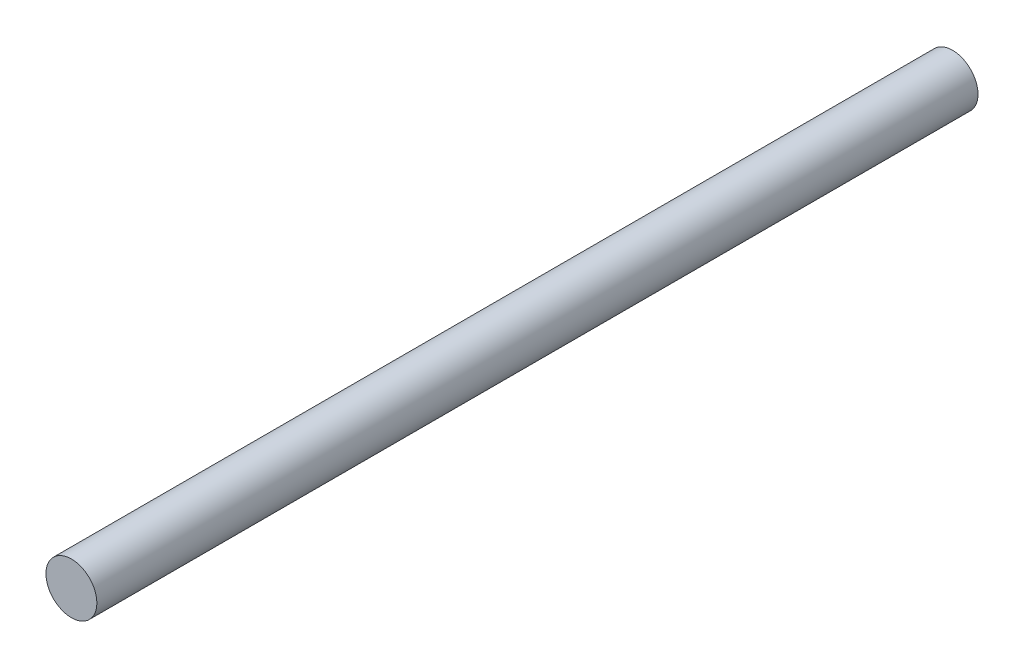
ISO-10303-21;
HEADER;
FILE_DESCRIPTION(('STEP AP214'),'2;1');
FILE_NAME('part.step','',(''),(''),'','','');
FILE_SCHEMA(('AUTOMOTIVE_DESIGN { 1 0 10303 214 1 1 1 1 }'));
ENDSEC;
DATA;
#1=APPLICATION_CONTEXT('core data for automotive mechanical design processes');
#2=APPLICATION_PROTOCOL_DEFINITION('international standard','automotive_design',2000,#1);
#3=PRODUCT_CONTEXT('',#1,'mechanical');
#4=PRODUCT('Part','Part','',(#3));
#5=PRODUCT_RELATED_PRODUCT_CATEGORY('part','',(#4));
#6=PRODUCT_DEFINITION_FORMATION('','',#4);
#7=PRODUCT_DEFINITION_CONTEXT('part definition',#1,'design');
#8=PRODUCT_DEFINITION('design','',#6,#7);
#9=PRODUCT_DEFINITION_SHAPE('','',#8);
#10=(LENGTH_UNIT() NAMED_UNIT(*) SI_UNIT(.MILLI.,.METRE.));
#11=(NAMED_UNIT(*) PLANE_ANGLE_UNIT() SI_UNIT($,.RADIAN.));
#12=(NAMED_UNIT(*) SI_UNIT($,.STERADIAN.) SOLID_ANGLE_UNIT());
#13=UNCERTAINTY_MEASURE_WITH_UNIT(LENGTH_MEASURE(1.E-05),#10,'distance_accuracy_value','');
#14=(GEOMETRIC_REPRESENTATION_CONTEXT(3) GLOBAL_UNCERTAINTY_ASSIGNED_CONTEXT((#13)) GLOBAL_UNIT_ASSIGNED_CONTEXT((#10,
#11,#12)) REPRESENTATION_CONTEXT('',''));
#15=CARTESIAN_POINT('',(0.,0.,0.));
#16=DIRECTION('',(0.,0.,1.));
#17=DIRECTION('',(1.,0.,0.));
#18=AXIS2_PLACEMENT_3D('',#15,#16,#17);
#19=CARTESIAN_POINT('',(0.,0.,225.));
#20=DIRECTION('',(0.,0.,-1.));
#21=DIRECTION('',(-1.,0.,0.));
#22=AXIS2_PLACEMENT_3D('',#19,#20,#21);
#23=CYLINDRICAL_SURFACE('',#22,6.5);
#24=CARTESIAN_POINT('',(0.,0.,225.));
#25=DIRECTION('',(0.,0.,1.));
#26=DIRECTION('',(1.,0.,0.));
#27=AXIS2_PLACEMENT_3D('',#24,#25,#26);
#28=CIRCLE('',#27,6.5);
#29=CARTESIAN_POINT('',(6.5,0.,225.));
#30=VERTEX_POINT('',#29);
#31=EDGE_CURVE('E10',#30,#30,#28,.T.);
#32=ORIENTED_EDGE('',*,*,#31,.F.);
#33=EDGE_LOOP('',(#32));
#34=FACE_BOUND('',#33,.T.);
#35=CARTESIAN_POINT('',(0.,0.,0.));
#36=DIRECTION('',(0.,0.,1.));
#37=DIRECTION('',(1.,0.,0.));
#38=AXIS2_PLACEMENT_3D('',#35,#36,#37);
#39=CIRCLE('',#38,6.5);
#40=CARTESIAN_POINT('',(6.5,0.,0.));
#41=VERTEX_POINT('',#40);
#42=EDGE_CURVE('E33',#41,#41,#39,.T.);
#43=ORIENTED_EDGE('',*,*,#42,.T.);
#44=EDGE_LOOP('',(#43));
#45=FACE_BOUND('',#44,.T.);
#46=ADVANCED_FACE('F30',(#34,#45),#23,.T.);
#47=CARTESIAN_POINT('',(0.,0.,225.));
#48=DIRECTION('',(0.,0.,1.));
#49=DIRECTION('',(1.,0.,0.));
#50=AXIS2_PLACEMENT_3D('',#47,#48,#49);
#51=PLANE('',#50);
#52=ORIENTED_EDGE('',*,*,#31,.T.);
#53=EDGE_LOOP('',(#52));
#54=FACE_BOUND('',#53,.T.);
#55=ADVANCED_FACE('F45',(#54),#51,.T.);
#56=CARTESIAN_POINT('',(0.,0.,0.));
#57=DIRECTION('',(0.,0.,1.));
#58=DIRECTION('',(1.,0.,0.));
#59=AXIS2_PLACEMENT_3D('',#56,#57,#58);
#60=PLANE('',#59);
#61=ORIENTED_EDGE('',*,*,#42,.F.);
#62=EDGE_LOOP('',(#61));
#63=FACE_BOUND('',#62,.T.);
#64=ADVANCED_FACE('F43',(#63),#60,.F.);
#65=CLOSED_SHELL('',(#46,#55,#64));
#66=MANIFOLD_SOLID_BREP('B2',#65);
#67=ADVANCED_BREP_SHAPE_REPRESENTATION('',(#18,#66),#14);
#68=SHAPE_DEFINITION_REPRESENTATION(#9,#67);
ENDSEC;
END-ISO-10303-21;
